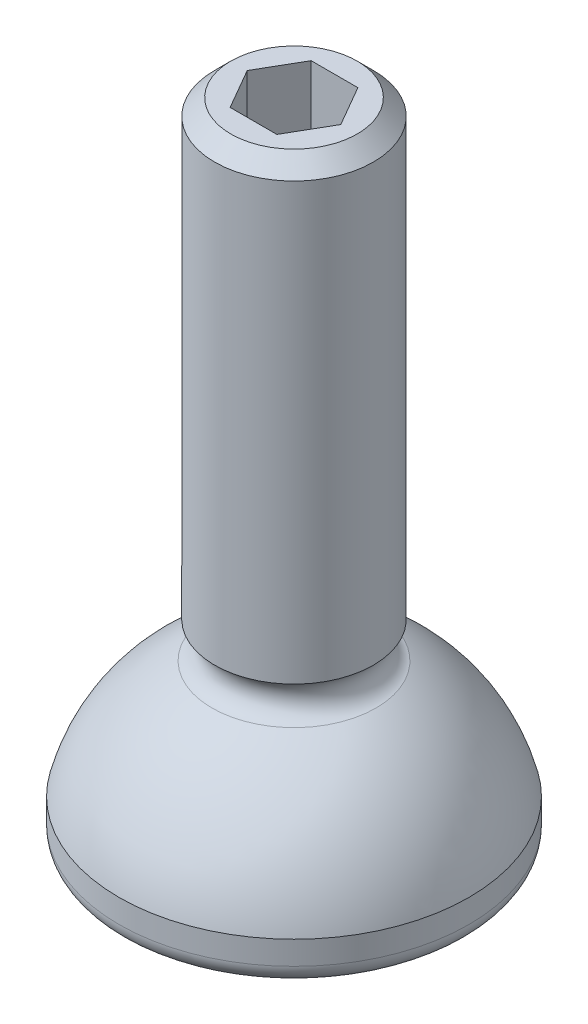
ISO-10303-21;
HEADER;
FILE_DESCRIPTION(('STEP AP214'),'2;1');
FILE_NAME('part.step','',(''),(''),'','','');
FILE_SCHEMA(('AUTOMOTIVE_DESIGN { 1 0 10303 214 1 1 1 1 }'));
ENDSEC;
DATA;
#1=APPLICATION_CONTEXT('core data for automotive mechanical design processes');
#2=APPLICATION_PROTOCOL_DEFINITION('international standard','automotive_design',2000,#1);
#3=PRODUCT_CONTEXT('',#1,'mechanical');
#4=PRODUCT('Part','Part','',(#3));
#5=PRODUCT_RELATED_PRODUCT_CATEGORY('part','',(#4));
#6=PRODUCT_DEFINITION_FORMATION('','',#4);
#7=PRODUCT_DEFINITION_CONTEXT('part definition',#1,'design');
#8=PRODUCT_DEFINITION('design','',#6,#7);
#9=PRODUCT_DEFINITION_SHAPE('','',#8);
#10=(LENGTH_UNIT() NAMED_UNIT(*) SI_UNIT(.MILLI.,.METRE.));
#11=(NAMED_UNIT(*) PLANE_ANGLE_UNIT() SI_UNIT($,.RADIAN.));
#12=(NAMED_UNIT(*) SI_UNIT($,.STERADIAN.) SOLID_ANGLE_UNIT());
#13=UNCERTAINTY_MEASURE_WITH_UNIT(LENGTH_MEASURE(1.E-05),#10,'distance_accuracy_value','');
#14=(GEOMETRIC_REPRESENTATION_CONTEXT(3) GLOBAL_UNCERTAINTY_ASSIGNED_CONTEXT((#13)) GLOBAL_UNIT_ASSIGNED_CONTEXT((#10,
#11,#12)) REPRESENTATION_CONTEXT('',''));
#15=CARTESIAN_POINT('',(0.,0.,0.));
#16=DIRECTION('',(0.,0.,1.));
#17=DIRECTION('',(1.,0.,0.));
#18=AXIS2_PLACEMENT_3D('',#15,#16,#17);
#19=CARTESIAN_POINT('',(3.49148336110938E-12,-1000.,0.));
#20=DIRECTION('',(0.,-1.,0.));
#21=DIRECTION('',(1.,0.,0.));
#22=AXIS2_PLACEMENT_3D('',#19,#20,#21);
#23=CYLINDRICAL_SURFACE('',#22,3.11150000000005);
#24=CARTESIAN_POINT('',(0.,7.69088775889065,0.));
#25=DIRECTION('',(0.,-1.,0.));
#26=DIRECTION('',(1.,0.,0.));
#27=AXIS2_PLACEMENT_3D('',#24,#25,#26);
#28=CIRCLE('',#27,3.11150000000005);
#29=CARTESIAN_POINT('',(3.11150000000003,7.69088775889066,0.));
#30=VERTEX_POINT('',#29);
#31=EDGE_CURVE('E36',#30,#30,#28,.T.);
#32=ORIENTED_EDGE('',*,*,#31,.F.);
#33=EDGE_LOOP('',(#32));
#34=FACE_BOUND('',#33,.T.);
#35=CARTESIAN_POINT('',(0.,24.7649999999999,0.));
#36=DIRECTION('',(0.,1.,0.));
#37=DIRECTION('',(-1.,0.,0.));
#38=AXIS2_PLACEMENT_3D('',#35,#36,#37);
#39=CIRCLE('',#38,3.11150000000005);
#40=CARTESIAN_POINT('',(-3.11150000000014,24.7649999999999,0.));
#41=VERTEX_POINT('',#40);
#42=EDGE_CURVE('E177',#41,#41,#39,.F.);
#43=ORIENTED_EDGE('',*,*,#42,.T.);
#44=EDGE_LOOP('',(#43));
#45=FACE_BOUND('',#44,.T.);
#46=ADVANCED_FACE('F32',(#34,#45),#23,.T.);
#47=CARTESIAN_POINT('',(3.1115,25.4,0.));
#48=DIRECTION('',(0.,1.,0.));
#49=DIRECTION('',(-1.,0.,0.));
#50=AXIS2_PLACEMENT_3D('',#47,#48,#49);
#51=PLANE('',#50);
#52=DIRECTION('',(1.,0.,0.));
#53=VECTOR('',#52,1.);
#54=CARTESIAN_POINT('',(-0.916543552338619,25.4,1.5875));
#55=LINE('',#54,#53);
#56=CARTESIAN_POINT('',(-0.916543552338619,25.4,1.5875));
#57=VERTEX_POINT('',#56);
#58=CARTESIAN_POINT('',(0.916543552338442,25.4,1.5875));
#59=VERTEX_POINT('',#58);
#60=EDGE_CURVE('E154',#57,#59,#55,.T.);
#61=ORIENTED_EDGE('',*,*,#60,.F.);
#62=DIRECTION('',(0.5,0.,0.866025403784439));
#63=VECTOR('',#62,1.);
#64=CARTESIAN_POINT('',(-1.83308710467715,25.4,0.));
#65=LINE('',#64,#63);
#66=CARTESIAN_POINT('',(-1.83308710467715,25.4,0.));
#67=VERTEX_POINT('',#66);
#68=EDGE_CURVE('E152',#67,#57,#65,.T.);
#69=ORIENTED_EDGE('',*,*,#68,.F.);
#70=DIRECTION('',(-0.5,0.,0.866025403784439));
#71=VECTOR('',#70,1.);
#72=CARTESIAN_POINT('',(-0.916543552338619,25.4,-1.5875));
#73=LINE('',#72,#71);
#74=CARTESIAN_POINT('',(-0.916543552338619,25.4,-1.5875));
#75=VERTEX_POINT('',#74);
#76=EDGE_CURVE('E150',#75,#67,#73,.T.);
#77=ORIENTED_EDGE('',*,*,#76,.F.);
#78=DIRECTION('',(-1.,0.,0.));
#79=VECTOR('',#78,1.);
#80=CARTESIAN_POINT('',(0.916543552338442,25.4,-1.5875));
#81=LINE('',#80,#79);
#82=CARTESIAN_POINT('',(0.916543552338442,25.4,-1.5875));
#83=VERTEX_POINT('',#82);
#84=EDGE_CURVE('E147',#83,#75,#81,.T.);
#85=ORIENTED_EDGE('',*,*,#84,.F.);
#86=DIRECTION('',(-0.5,0.,-0.866025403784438));
#87=VECTOR('',#86,1.);
#88=CARTESIAN_POINT('',(1.83308710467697,25.4,0.));
#89=LINE('',#88,#87);
#90=CARTESIAN_POINT('',(1.83308710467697,25.4,0.));
#91=VERTEX_POINT('',#90);
#92=EDGE_CURVE('E118',#91,#83,#89,.T.);
#93=ORIENTED_EDGE('',*,*,#92,.F.);
#94=DIRECTION('',(0.5,0.,-0.866025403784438));
#95=VECTOR('',#94,1.);
#96=CARTESIAN_POINT('',(0.916543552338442,25.4,1.5875));
#97=LINE('',#96,#95);
#98=EDGE_CURVE('E112',#59,#91,#97,.T.);
#99=ORIENTED_EDGE('',*,*,#98,.F.);
#100=EDGE_LOOP('',(#61,#69,#77,#85,#93,#99));
#101=FACE_BOUND('',#100,.T.);
#102=CARTESIAN_POINT('',(0.,25.4,0.));
#103=DIRECTION('',(0.,1.,0.));
#104=DIRECTION('',(-1.,0.,0.));
#105=AXIS2_PLACEMENT_3D('',#102,#103,#104);
#106=CIRCLE('',#105,2.47650000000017);
#107=CARTESIAN_POINT('',(-2.47650000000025,25.4,0.));
#108=VERTEX_POINT('',#107);
#109=EDGE_CURVE('E180',#108,#108,#106,.T.);
#110=ORIENTED_EDGE('',*,*,#109,.T.);
#111=EDGE_LOOP('',(#110));
#112=FACE_BOUND('',#111,.T.);
#113=ADVANCED_FACE('F243',(#101,#112),#51,.T.);
#114=CARTESIAN_POINT('',(0.,24.7649999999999,0.));
#115=DIRECTION('',(0.,-1.,0.));
#116=DIRECTION('',(1.,0.,0.));
#117=AXIS2_PLACEMENT_3D('',#114,#115,#116);
#118=CONICAL_SURFACE('',#117,3.11150000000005,0.785398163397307);
#119=ORIENTED_EDGE('',*,*,#109,.F.);
#120=EDGE_LOOP('',(#119));
#121=FACE_BOUND('',#120,.T.);
#122=ORIENTED_EDGE('',*,*,#42,.F.);
#123=EDGE_LOOP('',(#122));
#124=FACE_BOUND('',#123,.T.);
#125=ADVANCED_FACE('F249',(#121,#124),#118,.T.);
#126=CARTESIAN_POINT('',(1.83308710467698,22.098,0.));
#127=DIRECTION('',(0.866025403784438,0.,-0.5));
#128=DIRECTION('',(-0.5,0.,-0.866025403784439));
#129=AXIS2_PLACEMENT_3D('',#126,#127,#128);
#130=PLANE('',#129);
#131=ORIENTED_EDGE('',*,*,#92,.T.);
#132=DIRECTION('',(0.,1.,0.));
#133=VECTOR('',#132,1.);
#134=CARTESIAN_POINT('',(0.916543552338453,22.098,-1.5875));
#135=LINE('',#134,#133);
#136=CARTESIAN_POINT('',(0.916543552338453,22.098,-1.5875));
#137=VERTEX_POINT('',#136);
#138=EDGE_CURVE('E115',#137,#83,#135,.T.);
#139=ORIENTED_EDGE('',*,*,#138,.F.);
#140=DIRECTION('',(-0.5,0.,-0.866025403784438));
#141=VECTOR('',#140,1.);
#142=CARTESIAN_POINT('',(1.83308710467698,22.098,0.));
#143=LINE('',#142,#141);
#144=CARTESIAN_POINT('',(1.37481532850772,22.098,-0.793750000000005));
#145=VERTEX_POINT('',#144);
#146=EDGE_CURVE('E105',#145,#137,#143,.T.);
#147=ORIENTED_EDGE('',*,*,#146,.F.);
#148=CARTESIAN_POINT('',(1.83308710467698,22.098,0.));
#149=VERTEX_POINT('',#148);
#150=EDGE_CURVE('E49',#149,#145,#143,.T.);
#151=ORIENTED_EDGE('',*,*,#150,.F.);
#152=DIRECTION('',(0.,1.,0.));
#153=VECTOR('',#152,1.);
#154=CARTESIAN_POINT('',(1.83308710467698,22.098,0.));
#155=LINE('',#154,#153);
#156=EDGE_CURVE('E158',#149,#91,#155,.T.);
#157=ORIENTED_EDGE('',*,*,#156,.T.);
#158=EDGE_LOOP('',(#131,#139,#147,#151,#157));
#159=FACE_BOUND('',#158,.T.);
#160=ADVANCED_FACE('F116',(#159),#130,.F.);
#161=CARTESIAN_POINT('',(0.916543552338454,22.098,1.5875));
#162=DIRECTION('',(0.866025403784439,0.,0.5));
#163=DIRECTION('',(0.5,0.,-0.866025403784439));
#164=AXIS2_PLACEMENT_3D('',#161,#162,#163);
#165=PLANE('',#164);
#166=ORIENTED_EDGE('',*,*,#98,.T.);
#167=ORIENTED_EDGE('',*,*,#156,.F.);
#168=DIRECTION('',(0.5,0.,-0.866025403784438));
#169=VECTOR('',#168,1.);
#170=CARTESIAN_POINT('',(0.916543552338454,22.098,1.5875));
#171=LINE('',#170,#169);
#172=CARTESIAN_POINT('',(1.37481532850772,22.098,0.793750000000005));
#173=VERTEX_POINT('',#172);
#174=EDGE_CURVE('E143',#173,#149,#171,.T.);
#175=ORIENTED_EDGE('',*,*,#174,.F.);
#176=CARTESIAN_POINT('',(0.916543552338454,22.098,1.5875));
#177=VERTEX_POINT('',#176);
#178=EDGE_CURVE('E122',#177,#173,#171,.T.);
#179=ORIENTED_EDGE('',*,*,#178,.F.);
#180=DIRECTION('',(0.,1.,0.));
#181=VECTOR('',#180,1.);
#182=CARTESIAN_POINT('',(0.916543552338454,22.098,1.5875));
#183=LINE('',#182,#181);
#184=EDGE_CURVE('E161',#177,#59,#183,.T.);
#185=ORIENTED_EDGE('',*,*,#184,.T.);
#186=EDGE_LOOP('',(#166,#167,#175,#179,#185));
#187=FACE_BOUND('',#186,.T.);
#188=ADVANCED_FACE('F227',(#187),#165,.F.);
#189=CARTESIAN_POINT('',(-0.916543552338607,22.098,1.5875));
#190=DIRECTION('',(0.,0.,1.));
#191=DIRECTION('',(1.,0.,0.));
#192=AXIS2_PLACEMENT_3D('',#189,#190,#191);
#193=PLANE('',#192);
#194=ORIENTED_EDGE('',*,*,#60,.T.);
#195=ORIENTED_EDGE('',*,*,#184,.F.);
#196=DIRECTION('',(1.,0.,0.));
#197=VECTOR('',#196,1.);
#198=CARTESIAN_POINT('',(-0.916543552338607,22.098,1.5875));
#199=LINE('',#198,#197);
#200=CARTESIAN_POINT('',(0.,22.098,1.5875));
#201=VERTEX_POINT('',#200);
#202=EDGE_CURVE('E139',#201,#177,#199,.T.);
#203=ORIENTED_EDGE('',*,*,#202,.F.);
#204=CARTESIAN_POINT('',(-0.916543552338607,22.098,1.5875));
#205=VERTEX_POINT('',#204);
#206=EDGE_CURVE('E140',#205,#201,#199,.T.);
#207=ORIENTED_EDGE('',*,*,#206,.F.);
#208=DIRECTION('',(0.,1.,0.));
#209=VECTOR('',#208,1.);
#210=CARTESIAN_POINT('',(-0.916543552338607,22.098,1.5875));
#211=LINE('',#210,#209);
#212=EDGE_CURVE('E164',#205,#57,#211,.T.);
#213=ORIENTED_EDGE('',*,*,#212,.T.);
#214=EDGE_LOOP('',(#194,#195,#203,#207,#213));
#215=FACE_BOUND('',#214,.T.);
#216=ADVANCED_FACE('F219',(#215),#193,.F.);
#217=CARTESIAN_POINT('',(-1.83308710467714,22.098,0.));
#218=DIRECTION('',(-0.866025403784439,0.,0.5));
#219=DIRECTION('',(0.5,0.,0.866025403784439));
#220=AXIS2_PLACEMENT_3D('',#217,#218,#219);
#221=PLANE('',#220);
#222=ORIENTED_EDGE('',*,*,#68,.T.);
#223=ORIENTED_EDGE('',*,*,#212,.F.);
#224=DIRECTION('',(0.5,0.,0.866025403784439));
#225=VECTOR('',#224,1.);
#226=CARTESIAN_POINT('',(-1.83308710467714,22.098,0.));
#227=LINE('',#226,#225);
#228=CARTESIAN_POINT('',(-1.37481532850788,22.098,0.793749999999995));
#229=VERTEX_POINT('',#228);
#230=EDGE_CURVE('E135',#229,#205,#227,.T.);
#231=ORIENTED_EDGE('',*,*,#230,.F.);
#232=CARTESIAN_POINT('',(-1.83308710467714,22.098,0.));
#233=VERTEX_POINT('',#232);
#234=EDGE_CURVE('E136',#233,#229,#227,.T.);
#235=ORIENTED_EDGE('',*,*,#234,.F.);
#236=DIRECTION('',(0.,1.,0.));
#237=VECTOR('',#236,1.);
#238=CARTESIAN_POINT('',(-1.83308710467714,22.098,0.));
#239=LINE('',#238,#237);
#240=EDGE_CURVE('E167',#233,#67,#239,.T.);
#241=ORIENTED_EDGE('',*,*,#240,.T.);
#242=EDGE_LOOP('',(#222,#223,#231,#235,#241));
#243=FACE_BOUND('',#242,.T.);
#244=ADVANCED_FACE('F211',(#243),#221,.F.);
#245=CARTESIAN_POINT('',(-0.916543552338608,22.098,-1.5875));
#246=DIRECTION('',(-0.866025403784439,0.,-0.5));
#247=DIRECTION('',(-0.5,0.,0.866025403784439));
#248=AXIS2_PLACEMENT_3D('',#245,#246,#247);
#249=PLANE('',#248);
#250=ORIENTED_EDGE('',*,*,#76,.T.);
#251=ORIENTED_EDGE('',*,*,#240,.F.);
#252=DIRECTION('',(-0.5,0.,0.866025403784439));
#253=VECTOR('',#252,1.);
#254=CARTESIAN_POINT('',(-0.916543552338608,22.098,-1.5875));
#255=LINE('',#254,#253);
#256=CARTESIAN_POINT('',(-1.37481532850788,22.098,-0.793749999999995));
#257=VERTEX_POINT('',#256);
#258=EDGE_CURVE('E128',#257,#233,#255,.T.);
#259=ORIENTED_EDGE('',*,*,#258,.F.);
#260=CARTESIAN_POINT('',(-0.916543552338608,22.098,-1.5875));
#261=VERTEX_POINT('',#260);
#262=EDGE_CURVE('E130',#261,#257,#255,.T.);
#263=ORIENTED_EDGE('',*,*,#262,.F.);
#264=DIRECTION('',(0.,1.,0.));
#265=VECTOR('',#264,1.);
#266=CARTESIAN_POINT('',(-0.916543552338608,22.098,-1.5875));
#267=LINE('',#266,#265);
#268=EDGE_CURVE('E121',#261,#75,#267,.T.);
#269=ORIENTED_EDGE('',*,*,#268,.T.);
#270=EDGE_LOOP('',(#250,#251,#259,#263,#269));
#271=FACE_BOUND('',#270,.T.);
#272=ADVANCED_FACE('F203',(#271),#249,.F.);
#273=CARTESIAN_POINT('',(0.916543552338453,22.098,-1.5875));
#274=DIRECTION('',(0.,0.,-1.));
#275=DIRECTION('',(-1.,0.,0.));
#276=AXIS2_PLACEMENT_3D('',#273,#274,#275);
#277=PLANE('',#276);
#278=ORIENTED_EDGE('',*,*,#84,.T.);
#279=ORIENTED_EDGE('',*,*,#268,.F.);
#280=DIRECTION('',(-1.,0.,0.));
#281=VECTOR('',#280,1.);
#282=CARTESIAN_POINT('',(0.916543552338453,22.098,-1.5875));
#283=LINE('',#282,#281);
#284=CARTESIAN_POINT('',(0.,22.098,-1.5875));
#285=VERTEX_POINT('',#284);
#286=EDGE_CURVE('E127',#285,#261,#283,.T.);
#287=ORIENTED_EDGE('',*,*,#286,.F.);
#288=EDGE_CURVE('E109',#137,#285,#283,.T.);
#289=ORIENTED_EDGE('',*,*,#288,.F.);
#290=ORIENTED_EDGE('',*,*,#138,.T.);
#291=EDGE_LOOP('',(#278,#279,#287,#289,#290));
#292=FACE_BOUND('',#291,.T.);
#293=ADVANCED_FACE('F125',(#292),#277,.F.);
#294=CARTESIAN_POINT('',(1.83308710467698,22.098,0.));
#295=DIRECTION('',(0.,-1.,0.));
#296=DIRECTION('',(1.,0.,0.));
#297=AXIS2_PLACEMENT_3D('',#294,#295,#296);
#298=PLANE('',#297);
#299=ORIENTED_EDGE('',*,*,#146,.T.);
#300=ORIENTED_EDGE('',*,*,#288,.T.);
#301=CARTESIAN_POINT('',(0.,22.098,0.));
#302=DIRECTION('',(0.,-1.,0.));
#303=DIRECTION('',(1.,0.,0.));
#304=AXIS2_PLACEMENT_3D('',#301,#302,#303);
#305=CIRCLE('',#304,1.5875);
#306=EDGE_CURVE('E11',#145,#285,#305,.F.);
#307=ORIENTED_EDGE('',*,*,#306,.F.);
#308=EDGE_LOOP('',(#299,#300,#307));
#309=FACE_BOUND('',#308,.T.);
#310=ADVANCED_FACE('F107',(#309),#298,.F.);
#311=ORIENTED_EDGE('',*,*,#286,.T.);
#312=ORIENTED_EDGE('',*,*,#262,.T.);
#313=EDGE_CURVE('E41',#285,#257,#305,.F.);
#314=ORIENTED_EDGE('',*,*,#313,.F.);
#315=EDGE_LOOP('',(#311,#312,#314));
#316=FACE_BOUND('',#315,.T.);
#317=ADVANCED_FACE('F199',(#316),#298,.F.);
#318=ORIENTED_EDGE('',*,*,#258,.T.);
#319=ORIENTED_EDGE('',*,*,#234,.T.);
#320=EDGE_CURVE('E193',#257,#229,#305,.F.);
#321=ORIENTED_EDGE('',*,*,#320,.F.);
#322=EDGE_LOOP('',(#318,#319,#321));
#323=FACE_BOUND('',#322,.T.);
#324=ADVANCED_FACE('F208',(#323),#298,.F.);
#325=ORIENTED_EDGE('',*,*,#230,.T.);
#326=ORIENTED_EDGE('',*,*,#206,.T.);
#327=EDGE_CURVE('E191',#229,#201,#305,.F.);
#328=ORIENTED_EDGE('',*,*,#327,.F.);
#329=EDGE_LOOP('',(#325,#326,#328));
#330=FACE_BOUND('',#329,.T.);
#331=ADVANCED_FACE('F216',(#330),#298,.F.);
#332=ORIENTED_EDGE('',*,*,#202,.T.);
#333=ORIENTED_EDGE('',*,*,#178,.T.);
#334=EDGE_CURVE('E188',#201,#173,#305,.F.);
#335=ORIENTED_EDGE('',*,*,#334,.F.);
#336=EDGE_LOOP('',(#332,#333,#335));
#337=FACE_BOUND('',#336,.T.);
#338=ADVANCED_FACE('F224',(#337),#298,.F.);
#339=ORIENTED_EDGE('',*,*,#174,.T.);
#340=ORIENTED_EDGE('',*,*,#150,.T.);
#341=EDGE_CURVE('E42',#173,#145,#305,.F.);
#342=ORIENTED_EDGE('',*,*,#341,.F.);
#343=EDGE_LOOP('',(#339,#340,#342));
#344=FACE_BOUND('',#343,.T.);
#345=ADVANCED_FACE('F230',(#344),#298,.F.);
#346=CARTESIAN_POINT('',(0.,20.574,0.));
#347=DIRECTION('',(0.,1.,0.));
#348=DIRECTION('',(0.,0.,1.));
#349=AXIS2_PLACEMENT_3D('',#346,#347,#348);
#350=CONICAL_SURFACE('',#349,1.5875,1.02974425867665);
#351=CARTESIAN_POINT('',(0.,19.6201337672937,0.));
#352=VERTEX_POINT('',#351);
#353=VERTEX_LOOP('',#352);
#354=FACE_BOUND('',#353,.T.);
#355=CARTESIAN_POINT('',(0.,20.574,0.));
#356=DIRECTION('',(0.,1.,0.));
#357=DIRECTION('',(0.,0.,1.));
#358=AXIS2_PLACEMENT_3D('',#355,#356,#357);
#359=CIRCLE('',#358,1.5875);
#360=CARTESIAN_POINT('',(0.,20.574,1.5875));
#361=VERTEX_POINT('',#360);
#362=EDGE_CURVE('E160',#361,#361,#359,.T.);
#363=ORIENTED_EDGE('',*,*,#362,.T.);
#364=EDGE_LOOP('',(#363));
#365=FACE_BOUND('',#364,.T.);
#366=ADVANCED_FACE('F232',(#354,#365),#350,.F.);
#367=CARTESIAN_POINT('',(0.,25.4,0.));
#368=DIRECTION('',(0.,1.,0.));
#369=DIRECTION('',(0.,0.,1.));
#370=AXIS2_PLACEMENT_3D('',#367,#368,#369);
#371=CYLINDRICAL_SURFACE('',#370,1.5875);
#372=ORIENTED_EDGE('',*,*,#341,.T.);
#373=ORIENTED_EDGE('',*,*,#306,.T.);
#374=ORIENTED_EDGE('',*,*,#313,.T.);
#375=ORIENTED_EDGE('',*,*,#320,.T.);
#376=ORIENTED_EDGE('',*,*,#327,.T.);
#377=ORIENTED_EDGE('',*,*,#334,.T.);
#378=EDGE_LOOP('',(#372,#373,#374,#375,#376,#377));
#379=FACE_BOUND('',#378,.T.);
#380=ORIENTED_EDGE('',*,*,#362,.F.);
#381=EDGE_LOOP('',(#380));
#382=FACE_BOUND('',#381,.T.);
#383=ADVANCED_FACE('F196',(#379,#382),#371,.F.);
#384=CARTESIAN_POINT('',(0.,7.0104,0.));
#385=DIRECTION('',(0.,-1.,0.));
#386=DIRECTION('',(1.,0.,0.));
#387=AXIS2_PLACEMENT_3D('',#384,#385,#386);
#388=TOROIDAL_SURFACE('',#387,3.45440000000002,0.762);
#389=CARTESIAN_POINT('',(0.,6.28725317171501,0.));
#390=DIRECTION('',(0.,-1.,0.));
#391=DIRECTION('',(1.,0.,0.));
#392=AXIS2_PLACEMENT_3D('',#389,#390,#391);
#393=CIRCLE('',#392,3.21418621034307);
#394=CARTESIAN_POINT('',(3.21418621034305,6.28725317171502,0.));
#395=VERTEX_POINT('',#394);
#396=EDGE_CURVE('E148',#395,#395,#393,.F.);
#397=ORIENTED_EDGE('',*,*,#396,.T.);
#398=EDGE_LOOP('',(#397));
#399=FACE_BOUND('',#398,.T.);
#400=ORIENTED_EDGE('',*,*,#31,.T.);
#401=EDGE_LOOP('',(#400));
#402=FACE_BOUND('',#401,.T.);
#403=ADVANCED_FACE('F265',(#399,#402),#388,.F.);
#404=CARTESIAN_POINT('',(0.,0.,0.));
#405=DIRECTION('',(0.,-1.,0.));
#406=DIRECTION('',(1.,0.,0.));
#407=AXIS2_PLACEMENT_3D('',#404,#405,#406);
#408=PLANE('',#407);
#409=CARTESIAN_POINT('',(0.,0.,0.));
#410=DIRECTION('',(0.,-1.,0.));
#411=DIRECTION('',(1.,0.,0.));
#412=AXIS2_PLACEMENT_3D('',#409,#410,#411);
#413=CIRCLE('',#412,6.09600000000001);
#414=CARTESIAN_POINT('',(6.09600000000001,0.,0.));
#415=VERTEX_POINT('',#414);
#416=EDGE_CURVE('E183',#415,#415,#413,.T.);
#417=ORIENTED_EDGE('',*,*,#416,.T.);
#418=EDGE_LOOP('',(#417));
#419=FACE_BOUND('',#418,.T.);
#420=ADVANCED_FACE('F263',(#419),#408,.T.);
#421=CARTESIAN_POINT('',(0.,0.761999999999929,0.));
#422=DIRECTION('',(0.,-1.,0.));
#423=DIRECTION('',(1.,0.,0.));
#424=AXIS2_PLACEMENT_3D('',#421,#422,#423);
#425=TOROIDAL_SURFACE('',#424,6.09600000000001,0.762);
#426=CARTESIAN_POINT('',(0.,0.761999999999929,0.));
#427=DIRECTION('',(0.,-1.,0.));
#428=DIRECTION('',(1.,0.,0.));
#429=AXIS2_PLACEMENT_3D('',#426,#427,#428);
#430=CIRCLE('',#429,6.858);
#431=CARTESIAN_POINT('',(6.858,0.761999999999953,0.));
#432=VERTEX_POINT('',#431);
#433=EDGE_CURVE('E186',#432,#432,#430,.F.);
#434=ORIENTED_EDGE('',*,*,#433,.F.);
#435=EDGE_LOOP('',(#434));
#436=FACE_BOUND('',#435,.T.);
#437=ORIENTED_EDGE('',*,*,#416,.F.);
#438=EDGE_LOOP('',(#437));
#439=FACE_BOUND('',#438,.T.);
#440=ADVANCED_FACE('F34',(#436,#439),#425,.T.);
#441=CARTESIAN_POINT('',(3.49148336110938E-12,-1000.,0.));
#442=DIRECTION('',(0.,-1.,0.));
#443=DIRECTION('',(1.,0.,0.));
#444=AXIS2_PLACEMENT_3D('',#441,#442,#443);
#445=CYLINDRICAL_SURFACE('',#444,6.858);
#446=ORIENTED_EDGE('',*,*,#433,.T.);
#447=EDGE_LOOP('',(#446));
#448=FACE_BOUND('',#447,.T.);
#449=CARTESIAN_POINT('',(0.,1.68177924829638,0.));
#450=DIRECTION('',(0.,-1.,0.));
#451=DIRECTION('',(1.,0.,0.));
#452=AXIS2_PLACEMENT_3D('',#449,#450,#451);
#453=CIRCLE('',#452,6.85800000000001);
#454=CARTESIAN_POINT('',(6.85799999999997,1.6817792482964,0.));
#455=VERTEX_POINT('',#454);
#456=EDGE_CURVE('E174',#455,#455,#453,.T.);
#457=ORIENTED_EDGE('',*,*,#456,.T.);
#458=EDGE_LOOP('',(#457));
#459=FACE_BOUND('',#458,.T.);
#460=ADVANCED_FACE('F258',(#448,#459),#445,.T.);
#461=CARTESIAN_POINT('',(0.,0.,0.));
#462=DIRECTION('',(0.,-1.,0.));
#463=DIRECTION('',(1.,0.,0.));
#464=AXIS2_PLACEMENT_3D('',#461,#462,#463);
#465=SPHERICAL_SURFACE('',#464,7.0612);
#466=CARTESIAN_POINT('',(3.21418621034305,6.28725317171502,0.));
#467=CARTESIAN_POINT('',(3.27036081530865,6.25853568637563,0.));
#468=CARTESIAN_POINT('',(3.32615034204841,6.22906497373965,0.));
#469=CARTESIAN_POINT('',(3.43691961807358,6.16863910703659,0.));
#470=CARTESIAN_POINT('',(3.49189936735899,6.1376839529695,0.));
#471=CARTESIAN_POINT('',(3.6010094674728,6.07431121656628,0.));
#472=CARTESIAN_POINT('',(3.6551398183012,6.04189363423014,0.));
#473=CARTESIAN_POINT('',(3.76251226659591,5.97561939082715,0.));
#474=CARTESIAN_POINT('',(3.81575436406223,5.94176272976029,0.));
#475=CARTESIAN_POINT('',(3.92131204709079,5.87263463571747,0.));
#476=CARTESIAN_POINT('',(3.97362763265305,5.83736320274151,0.));
#477=CARTESIAN_POINT('',(4.07729471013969,5.76543090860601,0.));
#478=CARTESIAN_POINT('',(4.12864620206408,5.72877004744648,0.));
#479=CARTESIAN_POINT('',(4.23034820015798,5.65408523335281,0.));
#480=CARTESIAN_POINT('',(4.28069870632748,5.61606128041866,0.));
#481=CARTESIAN_POINT('',(4.38036256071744,5.53867759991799,0.));
#482=CARTESIAN_POINT('',(4.42967590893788,5.49931787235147,0.));
#483=CARTESIAN_POINT('',(4.52723002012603,5.41929091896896,0.));
#484=CARTESIAN_POINT('',(4.57547078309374,5.37862369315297,0.));
#485=CARTESIAN_POINT('',(4.67084506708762,5.2960109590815,0.));
#486=CARTESIAN_POINT('',(4.7179785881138,5.25406545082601,0.));
#487=CARTESIAN_POINT('',(4.81110452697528,5.16892628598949,0.));
#488=CARTESIAN_POINT('',(4.85709694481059,5.12573262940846,0.));
#489=CARTESIAN_POINT('',(4.94790763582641,5.03812819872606,0.));
#490=CARTESIAN_POINT('',(4.99272590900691,4.99371742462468,0.));
#491=CARTESIAN_POINT('',(5.08115611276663,4.90371066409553,0.));
#492=CARTESIAN_POINT('',(5.12476804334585,4.85811467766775,0.));
#493=CARTESIAN_POINT('',(5.21075423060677,4.76577024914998,0.));
#494=CARTESIAN_POINT('',(5.25312848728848,4.71902180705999,0.));
#495=CARTESIAN_POINT('',(5.33660888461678,4.62440605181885,0.));
#496=CARTESIAN_POINT('',(5.37771502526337,4.57653873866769,0.));
#497=CARTESIAN_POINT('',(5.45862965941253,4.47971962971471,0.));
#498=CARTESIAN_POINT('',(5.4984381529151,4.43076783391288,0.));
#499=CARTESIAN_POINT('',(5.57672889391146,4.33181492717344,0.));
#500=CARTESIAN_POINT('',(5.61521114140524,4.28181381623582,0.));
#501=CARTESIAN_POINT('',(5.69082174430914,4.18079820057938,0.));
#502=CARTESIAN_POINT('',(5.72795009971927,4.12978369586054,0.));
#503=CARTESIAN_POINT('',(5.80082624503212,4.02677794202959,0.));
#504=CARTESIAN_POINT('',(5.83657403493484,3.97478669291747,0.));
#505=CARTESIAN_POINT('',(5.90666336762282,3.86986480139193,0.));
#506=CARTESIAN_POINT('',(5.94100491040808,3.81693415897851,0.));
#507=CARTESIAN_POINT('',(6.00825707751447,3.71017150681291,0.));
#508=CARTESIAN_POINT('',(6.0411677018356,3.65633949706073,0.));
#509=CARTESIAN_POINT('',(6.10553438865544,3.54781278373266,0.));
#510=CARTESIAN_POINT('',(6.13699045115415,3.49311808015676,0.));
#511=CARTESIAN_POINT('',(6.19842541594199,3.38290527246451,0.));
#512=CARTESIAN_POINT('',(6.22840431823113,3.32738716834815,0.));
#513=CARTESIAN_POINT('',(6.28686342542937,3.21556744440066,0.));
#514=CARTESIAN_POINT('',(6.31534363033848,3.15926582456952,0.));
#515=CARTESIAN_POINT('',(6.37078488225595,3.045919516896,0.));
#516=CARTESIAN_POINT('',(6.39774592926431,2.98887482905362,0.));
#517=CARTESIAN_POINT('',(6.4501294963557,2.87408336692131,0.));
#518=CARTESIAN_POINT('',(6.47555201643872,2.81633659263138,0.));
#519=CARTESIAN_POINT('',(6.52484026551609,2.70018244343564,0.));
#520=CARTESIAN_POINT('',(6.54870599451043,2.64177506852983,0.));
#521=CARTESIAN_POINT('',(6.59486351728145,2.52434167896,0.));
#522=CARTESIAN_POINT('',(6.61715531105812,2.46531566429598,0.));
#523=CARTESIAN_POINT('',(6.66014894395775,2.34668739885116,0.));
#524=CARTESIAN_POINT('',(6.6808507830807,2.28708514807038,0.));
#525=CARTESIAN_POINT('',(6.7206496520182,2.16734723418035,0.));
#526=CARTESIAN_POINT('',(6.73974668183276,2.10721157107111,0.));
#527=CARTESIAN_POINT('',(6.77632214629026,1.98645001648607,0.));
#528=CARTESIAN_POINT('',(6.79380058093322,1.92582412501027,0.));
#529=CARTESIAN_POINT('',(6.82712654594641,1.80412573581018,0.));
#530=CARTESIAN_POINT('',(6.84297407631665,1.74305323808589,0.));
#531=CARTESIAN_POINT('',(6.85799999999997,1.6817792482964,0.));
#532=B_SPLINE_CURVE_WITH_KNOTS('',3,(#466,#467,#468,#469,#470,#471,#472,#473,#474,#475,#476,
#477,#478,#479,#480,#481,#482,#483,#484,#485,#486,#487,#488,#489,#490,#491,#492,#493,#494,#495,
#496,#497,#498,#499,#500,#501,#502,#503,#504,#505,#506,#507,#508,#509,#510,#511,#512,#513,#514,
#515,#516,#517,#518,#519,#520,#521,#522,#523,#524,#525,#526,#527,#528,#529,#530,#531),
.UNSPECIFIED.,.F.,.F.,(4,2,2,2,2,2,2,2,2,2,2,2,2,2,2,2,2,2,2,2,2,2,2,2,2,2,2,2,2,2,2,2,4),(0.,
0.189262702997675,0.378525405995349,0.567788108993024,0.757050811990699,0.946313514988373,
1.13557621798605,1.32483892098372,1.5141016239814,1.70336432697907,1.89262702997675,
2.08188973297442,2.2711524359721,2.46041513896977,2.64967784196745,2.83894054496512,
3.0282032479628,3.21746595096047,3.40672865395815,3.59599135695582,3.78525405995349,
3.97451676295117,4.16377946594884,4.35304216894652,4.54230487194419,4.73156757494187,
4.92083027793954,5.11009298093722,5.29935568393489,5.48861838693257,5.67788108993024,
5.86714379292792,6.05640649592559),.UNSPECIFIED.);
#533=EDGE_CURVE('BSEAM255',#395,#455,#532,.T.);
#534=ORIENTED_EDGE('',*,*,#396,.F.);
#535=ORIENTED_EDGE('',*,*,#456,.F.);
#536=ORIENTED_EDGE('',*,*,#533,.T.);
#537=ORIENTED_EDGE('',*,*,#533,.F.);
#538=EDGE_LOOP('',(#534,#536,#535,#537));
#539=FACE_BOUND('',#538,.T.);
#540=ADVANCED_FACE('F255',(#539),#465,.T.);
#541=CLOSED_SHELL('',(#46,#113,#125,#160,#188,#216,#244,#272,#293,#310,#317,#324,#331,#338,#345,
#366,#383,#403,#420,#440,#460,#540));
#542=MANIFOLD_SOLID_BREP('B2',#541);
#543=ADVANCED_BREP_SHAPE_REPRESENTATION('',(#18,#542),#14);
#544=SHAPE_DEFINITION_REPRESENTATION(#9,#543);
ENDSEC;
END-ISO-10303-21;
